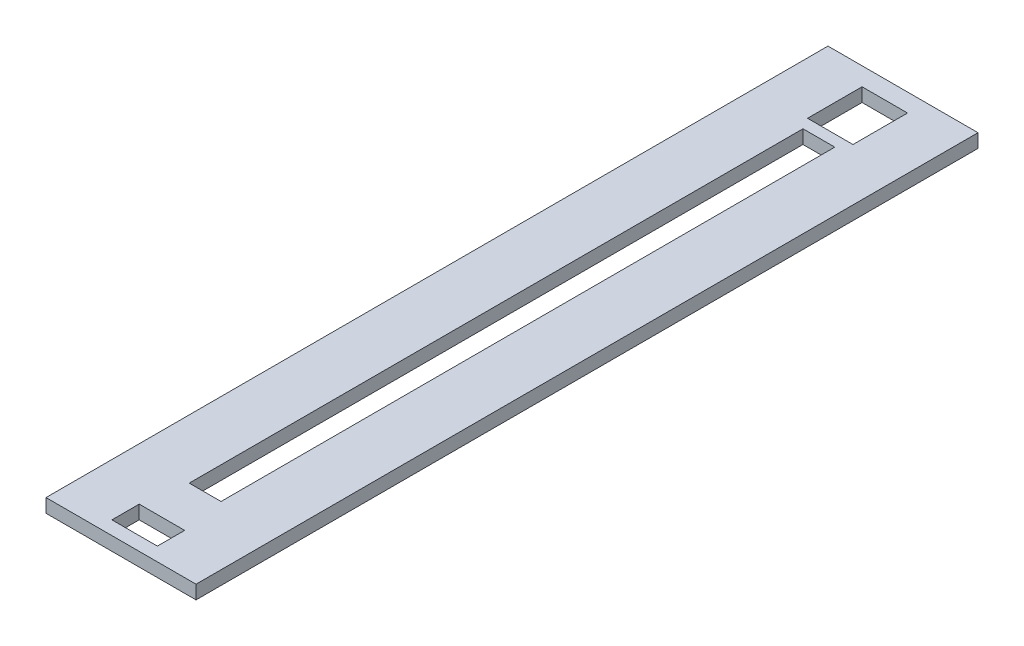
from build123d import *

# Parameters (mm, degrees)
SKETCH1_W           = 33
SKETCH1_H           = 172
SKETCH1_W_2         = 10
SKETCH1_H_2         = 12
SKETCH1_W_3         = 7
SKETCH1_H_3         = 135
SKETCH1_H_4         = 6
BOSS_EXTRUDE1_DEPTH = 3


with BuildPart() as part:
    # Sketch1 → Boss-Extrude1 (new body)
    with BuildSketch(Plane(origin=(0, 0, 0), x_dir=(1, 0, 0), z_dir=(0, 1, 0))):
        Rectangle(SKETCH1_W, SKETCH1_H)
        with Locations((0, 76)):
            Rectangle(SKETCH1_W_2, SKETCH1_H_2, mode=Mode.SUBTRACT)
        Rectangle(SKETCH1_W_3, SKETCH1_H_3, mode=Mode.SUBTRACT)
        with Locations((0, -80)):
            Rectangle(SKETCH1_W_2, SKETCH1_H_4, mode=Mode.SUBTRACT)
    extrude(amount=BOSS_EXTRUDE1_DEPTH)


solid = part.part
